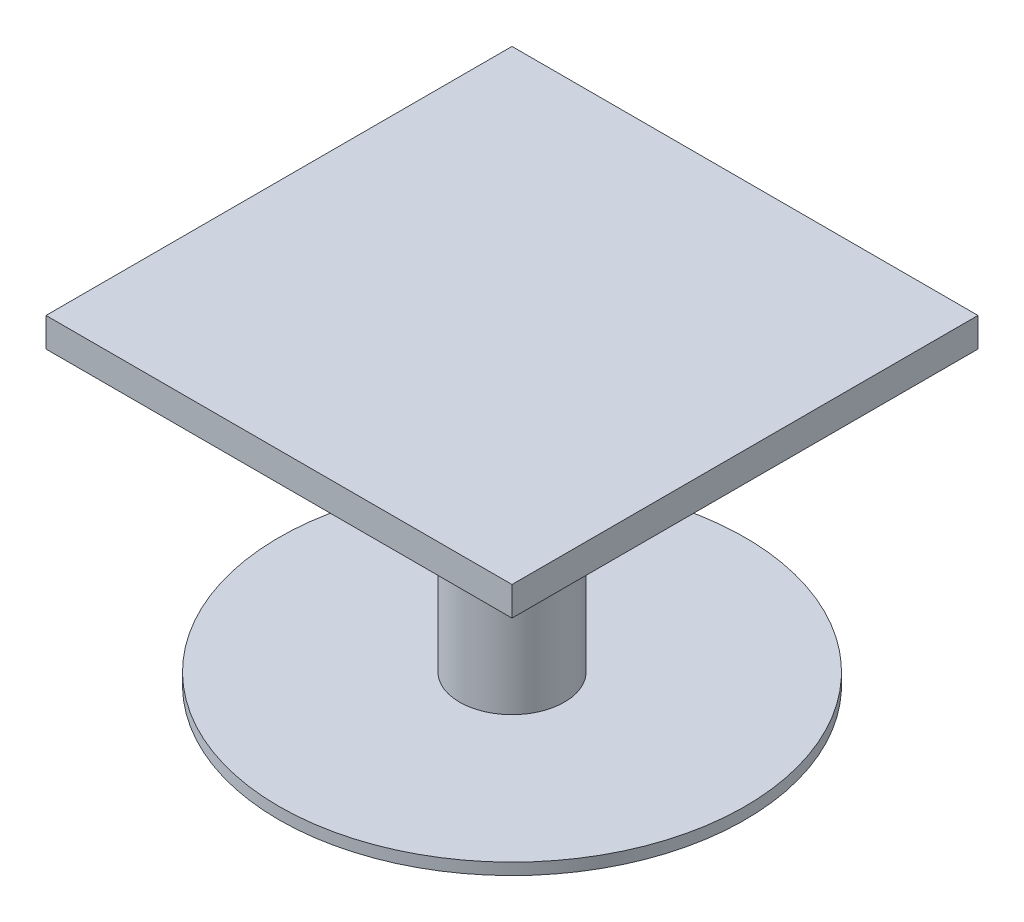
ISO-10303-21;
HEADER;
FILE_DESCRIPTION(('STEP AP214'),'2;1');
FILE_NAME('part.step','',(''),(''),'','','');
FILE_SCHEMA(('AUTOMOTIVE_DESIGN { 1 0 10303 214 1 1 1 1 }'));
ENDSEC;
DATA;
#1=APPLICATION_CONTEXT('core data for automotive mechanical design processes');
#2=APPLICATION_PROTOCOL_DEFINITION('international standard','automotive_design',2000,#1);
#3=PRODUCT_CONTEXT('',#1,'mechanical');
#4=PRODUCT('Part','Part','',(#3));
#5=PRODUCT_RELATED_PRODUCT_CATEGORY('part','',(#4));
#6=PRODUCT_DEFINITION_FORMATION('','',#4);
#7=PRODUCT_DEFINITION_CONTEXT('part definition',#1,'design');
#8=PRODUCT_DEFINITION('design','',#6,#7);
#9=PRODUCT_DEFINITION_SHAPE('','',#8);
#10=(LENGTH_UNIT() NAMED_UNIT(*) SI_UNIT(.MILLI.,.METRE.));
#11=(NAMED_UNIT(*) PLANE_ANGLE_UNIT() SI_UNIT($,.RADIAN.));
#12=(NAMED_UNIT(*) SI_UNIT($,.STERADIAN.) SOLID_ANGLE_UNIT());
#13=UNCERTAINTY_MEASURE_WITH_UNIT(LENGTH_MEASURE(1.E-05),#10,'distance_accuracy_value','');
#14=(GEOMETRIC_REPRESENTATION_CONTEXT(3) GLOBAL_UNCERTAINTY_ASSIGNED_CONTEXT((#13)) GLOBAL_UNIT_ASSIGNED_CONTEXT((#10,
#11,#12)) REPRESENTATION_CONTEXT('',''));
#15=CARTESIAN_POINT('',(0.,0.,0.));
#16=DIRECTION('',(0.,0.,1.));
#17=DIRECTION('',(1.,0.,0.));
#18=AXIS2_PLACEMENT_3D('',#15,#16,#17);
#19=CARTESIAN_POINT('',(0.,-68.,0.));
#20=DIRECTION('',(0.,1.,0.));
#21=DIRECTION('',(0.,0.,1.));
#22=AXIS2_PLACEMENT_3D('',#19,#20,#21);
#23=PLANE('',#22);
#24=CARTESIAN_POINT('',(0.,-68.,0.));
#25=DIRECTION('',(0.,1.,0.));
#26=DIRECTION('',(0.,0.,1.));
#27=AXIS2_PLACEMENT_3D('',#24,#25,#26);
#28=CIRCLE('',#27,40.);
#29=CARTESIAN_POINT('',(0.,-68.,40.));
#30=VERTEX_POINT('',#29);
#31=EDGE_CURVE('E11',#30,#30,#28,.T.);
#32=ORIENTED_EDGE('',*,*,#31,.T.);
#33=EDGE_LOOP('',(#32));
#34=FACE_BOUND('',#33,.T.);
#35=CARTESIAN_POINT('',(0.,-68.,0.));
#36=DIRECTION('',(0.,1.,0.));
#37=DIRECTION('',(0.,0.,1.));
#38=AXIS2_PLACEMENT_3D('',#35,#36,#37);
#39=CIRCLE('',#38,9.);
#40=CARTESIAN_POINT('',(0.,-68.,9.));
#41=VERTEX_POINT('',#40);
#42=EDGE_CURVE('E109',#41,#41,#39,.T.);
#43=ORIENTED_EDGE('',*,*,#42,.F.);
#44=EDGE_LOOP('',(#43));
#45=FACE_BOUND('',#44,.T.);
#46=ADVANCED_FACE('F32',(#34,#45),#23,.T.);
#47=CARTESIAN_POINT('',(0.,-68.,0.));
#48=DIRECTION('',(0.,-1.,0.));
#49=DIRECTION('',(0.,0.,-1.));
#50=AXIS2_PLACEMENT_3D('',#47,#48,#49);
#51=CYLINDRICAL_SURFACE('',#50,40.);
#52=ORIENTED_EDGE('',*,*,#31,.F.);
#53=EDGE_LOOP('',(#52));
#54=FACE_BOUND('',#53,.T.);
#55=CARTESIAN_POINT('',(0.,-70.,0.));
#56=DIRECTION('',(0.,1.,0.));
#57=DIRECTION('',(0.,0.,1.));
#58=AXIS2_PLACEMENT_3D('',#55,#56,#57);
#59=CIRCLE('',#58,40.);
#60=CARTESIAN_POINT('',(0.,-70.,40.));
#61=VERTEX_POINT('',#60);
#62=EDGE_CURVE('E36',#61,#61,#59,.T.);
#63=ORIENTED_EDGE('',*,*,#62,.T.);
#64=EDGE_LOOP('',(#63));
#65=FACE_BOUND('',#64,.T.);
#66=ADVANCED_FACE('F34',(#54,#65),#51,.T.);
#67=CARTESIAN_POINT('',(0.,-70.,0.));
#68=DIRECTION('',(0.,1.,0.));
#69=DIRECTION('',(0.,0.,1.));
#70=AXIS2_PLACEMENT_3D('',#67,#68,#69);
#71=PLANE('',#70);
#72=ORIENTED_EDGE('',*,*,#62,.F.);
#73=EDGE_LOOP('',(#72));
#74=FACE_BOUND('',#73,.T.);
#75=ADVANCED_FACE('F120',(#74),#71,.F.);
#76=CARTESIAN_POINT('',(0.,5.4558441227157,0.));
#77=DIRECTION('',(0.,-1.,0.));
#78=DIRECTION('',(0.,0.,-1.));
#79=AXIS2_PLACEMENT_3D('',#76,#77,#78);
#80=CYLINDRICAL_SURFACE('',#79,9.);
#81=ORIENTED_EDGE('',*,*,#42,.T.);
#82=EDGE_LOOP('',(#81));
#83=FACE_BOUND('',#82,.T.);
#84=CARTESIAN_POINT('',(0.,-20.,0.));
#85=DIRECTION('',(0.,1.,0.));
#86=DIRECTION('',(0.,0.,1.));
#87=AXIS2_PLACEMENT_3D('',#84,#85,#86);
#88=CIRCLE('',#87,9.);
#89=CARTESIAN_POINT('',(0.,-20.,9.));
#90=VERTEX_POINT('',#89);
#91=EDGE_CURVE('E112',#90,#90,#88,.T.);
#92=ORIENTED_EDGE('',*,*,#91,.F.);
#93=EDGE_LOOP('',(#92));
#94=FACE_BOUND('',#93,.T.);
#95=ADVANCED_FACE('F122',(#83,#94),#80,.T.);
#96=CARTESIAN_POINT('',(40.,-20.,-40.));
#97=DIRECTION('',(0.,1.,0.));
#98=DIRECTION('',(0.,0.,1.));
#99=AXIS2_PLACEMENT_3D('',#96,#97,#98);
#100=PLANE('',#99);
#101=DIRECTION('',(0.,0.,-1.));
#102=VECTOR('',#101,1.);
#103=CARTESIAN_POINT('',(40.,-20.,40.));
#104=LINE('',#103,#102);
#105=CARTESIAN_POINT('',(40.,-20.,40.));
#106=VERTEX_POINT('',#105);
#107=CARTESIAN_POINT('',(40.,-20.,-40.));
#108=VERTEX_POINT('',#107);
#109=EDGE_CURVE('E100',#106,#108,#104,.T.);
#110=ORIENTED_EDGE('',*,*,#109,.F.);
#111=DIRECTION('',(1.,0.,0.));
#112=VECTOR('',#111,1.);
#113=CARTESIAN_POINT('',(40.,-20.,40.));
#114=LINE('',#113,#112);
#115=CARTESIAN_POINT('',(-40.,-20.,40.));
#116=VERTEX_POINT('',#115);
#117=EDGE_CURVE('E72',#116,#106,#114,.T.);
#118=ORIENTED_EDGE('',*,*,#117,.F.);
#119=DIRECTION('',(0.,0.,1.));
#120=VECTOR('',#119,1.);
#121=CARTESIAN_POINT('',(-40.,-20.,40.));
#122=LINE('',#121,#120);
#123=CARTESIAN_POINT('',(-40.,-20.,-40.));
#124=VERTEX_POINT('',#123);
#125=EDGE_CURVE('E66',#124,#116,#122,.T.);
#126=ORIENTED_EDGE('',*,*,#125,.F.);
#127=DIRECTION('',(-1.,0.,0.));
#128=VECTOR('',#127,1.);
#129=CARTESIAN_POINT('',(40.,-20.,-40.));
#130=LINE('',#129,#128);
#131=EDGE_CURVE('E90',#108,#124,#130,.T.);
#132=ORIENTED_EDGE('',*,*,#131,.F.);
#133=EDGE_LOOP('',(#110,#118,#126,#132));
#134=FACE_BOUND('',#133,.T.);
#135=ORIENTED_EDGE('',*,*,#91,.T.);
#136=EDGE_LOOP('',(#135));
#137=FACE_BOUND('',#136,.T.);
#138=ADVANCED_FACE('F127',(#134,#137),#100,.F.);
#139=CARTESIAN_POINT('',(40.,-15.,40.));
#140=DIRECTION('',(-1.,0.,0.));
#141=DIRECTION('',(0.,0.,1.));
#142=AXIS2_PLACEMENT_3D('',#139,#140,#141);
#143=PLANE('',#142);
#144=ORIENTED_EDGE('',*,*,#109,.T.);
#145=DIRECTION('',(0.,-1.,0.));
#146=VECTOR('',#145,1.);
#147=CARTESIAN_POINT('',(40.,-15.,-40.));
#148=LINE('',#147,#146);
#149=CARTESIAN_POINT('',(40.,-15.,-40.));
#150=VERTEX_POINT('',#149);
#151=EDGE_CURVE('E91',#150,#108,#148,.T.);
#152=ORIENTED_EDGE('',*,*,#151,.F.);
#153=DIRECTION('',(0.,0.,-1.));
#154=VECTOR('',#153,1.);
#155=CARTESIAN_POINT('',(40.,-15.,40.));
#156=LINE('',#155,#154);
#157=CARTESIAN_POINT('',(40.,-15.,40.));
#158=VERTEX_POINT('',#157);
#159=EDGE_CURVE('E85',#158,#150,#156,.T.);
#160=ORIENTED_EDGE('',*,*,#159,.F.);
#161=DIRECTION('',(0.,-1.,0.));
#162=VECTOR('',#161,1.);
#163=CARTESIAN_POINT('',(40.,-15.,40.));
#164=LINE('',#163,#162);
#165=EDGE_CURVE('E96',#158,#106,#164,.T.);
#166=ORIENTED_EDGE('',*,*,#165,.T.);
#167=EDGE_LOOP('',(#144,#152,#160,#166));
#168=FACE_BOUND('',#167,.T.);
#169=ADVANCED_FACE('F138',(#168),#143,.F.);
#170=CARTESIAN_POINT('',(40.,-15.,-40.));
#171=DIRECTION('',(0.,0.,1.));
#172=DIRECTION('',(1.,0.,0.));
#173=AXIS2_PLACEMENT_3D('',#170,#171,#172);
#174=PLANE('',#173);
#175=ORIENTED_EDGE('',*,*,#131,.T.);
#176=DIRECTION('',(0.,-1.,0.));
#177=VECTOR('',#176,1.);
#178=CARTESIAN_POINT('',(-40.,-15.,-40.));
#179=LINE('',#178,#177);
#180=CARTESIAN_POINT('',(-40.,-15.,-40.));
#181=VERTEX_POINT('',#180);
#182=EDGE_CURVE('E88',#181,#124,#179,.T.);
#183=ORIENTED_EDGE('',*,*,#182,.F.);
#184=DIRECTION('',(-1.,0.,0.));
#185=VECTOR('',#184,1.);
#186=CARTESIAN_POINT('',(40.,-15.,-40.));
#187=LINE('',#186,#185);
#188=EDGE_CURVE('E80',#150,#181,#187,.T.);
#189=ORIENTED_EDGE('',*,*,#188,.F.);
#190=ORIENTED_EDGE('',*,*,#151,.T.);
#191=EDGE_LOOP('',(#175,#183,#189,#190));
#192=FACE_BOUND('',#191,.T.);
#193=ADVANCED_FACE('F89',(#192),#174,.F.);
#194=CARTESIAN_POINT('',(-40.,-15.,40.));
#195=DIRECTION('',(1.,0.,0.));
#196=DIRECTION('',(0.,0.,-1.));
#197=AXIS2_PLACEMENT_3D('',#194,#195,#196);
#198=PLANE('',#197);
#199=ORIENTED_EDGE('',*,*,#125,.T.);
#200=DIRECTION('',(0.,-1.,0.));
#201=VECTOR('',#200,1.);
#202=CARTESIAN_POINT('',(-40.,-15.,40.));
#203=LINE('',#202,#201);
#204=CARTESIAN_POINT('',(-40.,-15.,40.));
#205=VERTEX_POINT('',#204);
#206=EDGE_CURVE('E92',#205,#116,#203,.T.);
#207=ORIENTED_EDGE('',*,*,#206,.F.);
#208=DIRECTION('',(0.,0.,1.));
#209=VECTOR('',#208,1.);
#210=CARTESIAN_POINT('',(-40.,-15.,40.));
#211=LINE('',#210,#209);
#212=EDGE_CURVE('E83',#181,#205,#211,.T.);
#213=ORIENTED_EDGE('',*,*,#212,.F.);
#214=ORIENTED_EDGE('',*,*,#182,.T.);
#215=EDGE_LOOP('',(#199,#207,#213,#214));
#216=FACE_BOUND('',#215,.T.);
#217=ADVANCED_FACE('F94',(#216),#198,.F.);
#218=CARTESIAN_POINT('',(40.,-15.,40.));
#219=DIRECTION('',(0.,0.,-1.));
#220=DIRECTION('',(-1.,0.,0.));
#221=AXIS2_PLACEMENT_3D('',#218,#219,#220);
#222=PLANE('',#221);
#223=ORIENTED_EDGE('',*,*,#117,.T.);
#224=ORIENTED_EDGE('',*,*,#165,.F.);
#225=DIRECTION('',(1.,0.,0.));
#226=VECTOR('',#225,1.);
#227=CARTESIAN_POINT('',(40.,-15.,40.));
#228=LINE('',#227,#226);
#229=EDGE_CURVE('E49',#205,#158,#228,.T.);
#230=ORIENTED_EDGE('',*,*,#229,.F.);
#231=ORIENTED_EDGE('',*,*,#206,.T.);
#232=EDGE_LOOP('',(#223,#224,#230,#231));
#233=FACE_BOUND('',#232,.T.);
#234=ADVANCED_FACE('F146',(#233),#222,.F.);
#235=CARTESIAN_POINT('',(40.,-15.,-40.));
#236=DIRECTION('',(0.,1.,0.));
#237=DIRECTION('',(0.,0.,1.));
#238=AXIS2_PLACEMENT_3D('',#235,#236,#237);
#239=PLANE('',#238);
#240=ORIENTED_EDGE('',*,*,#159,.T.);
#241=ORIENTED_EDGE('',*,*,#188,.T.);
#242=ORIENTED_EDGE('',*,*,#212,.T.);
#243=ORIENTED_EDGE('',*,*,#229,.T.);
#244=EDGE_LOOP('',(#240,#241,#242,#243));
#245=FACE_BOUND('',#244,.T.);
#246=ADVANCED_FACE('F81',(#245),#239,.T.);
#247=CLOSED_SHELL('',(#46,#66,#75,#95,#138,#169,#193,#217,#234,#246));
#248=MANIFOLD_SOLID_BREP('B2',#247);
#249=ADVANCED_BREP_SHAPE_REPRESENTATION('',(#18,#248),#14);
#250=SHAPE_DEFINITION_REPRESENTATION(#9,#249);
ENDSEC;
END-ISO-10303-21;
